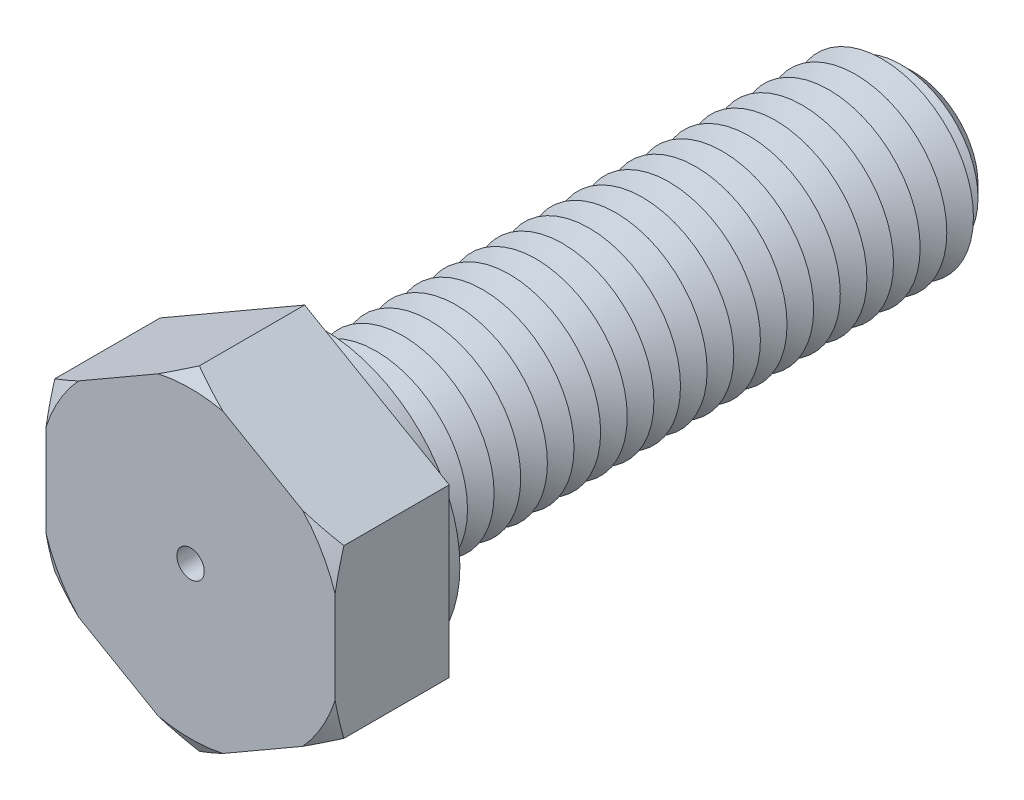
from build123d import *

# Parameters (mm, degrees)
BOSS_EXTRUDE1_DEPTH = 7.5
SKETCH3_R           = 6
BOSS_EXTRUDE2_DEPTH = 40
SKETCH4_R           = 9
BOSS_EXTRUDE3_DEPTH = 1.2
CHAMFER1_SIZE       = 1.75
LPATTERN1_COUNT     = 22
LPATTERN1_PITCH     = 1.75
SKETCH8_R           = 0.9
CUT_EXTRUDE1_DEPTH  = 47.5


with BuildPart() as part:
    # Sketch2 → Boss-Extrude1 (new body)
    with BuildSketch(Plane.XY):
        Polygon((0, 10.969655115), (-9.5, 5.484827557), (-9.5, -5.484827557), (0, -10.969655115), (9.5, -5.484827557), (9.5, 5.484827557), align=None)
    extrude(amount=BOSS_EXTRUDE1_DEPTH)

    # Sketch3 → Boss-Extrude2 (add)
    with BuildSketch(Plane(origin=(0, 0, 0), x_dir=(-1, 0, 0), z_dir=(0, 0, -1))):
        Circle(SKETCH3_R)
    extrude(amount=BOSS_EXTRUDE2_DEPTH)

    # Sketch4 → Boss-Extrude3 (add)
    with BuildSketch(Plane(origin=(0, 0, 0), x_dir=(-1, 0, 0), z_dir=(0, 0, -1))):
        with Locations(Location((0, 0, 0), (0, 0, 180))):
            Circle(SKETCH4_R)
    extrude(amount=BOSS_EXTRUDE3_DEPTH)

    # Chamfer1
    chamfer1_edges = [part.edges().sort_by_distance(p)[0] for p in [
        (6, 0, -40),
    ]]
    chamfer(chamfer1_edges, length=CHAMFER1_SIZE)

    # Sketch6 → Cut-Revolve1 (revolve, cut)
    with BuildSketch(Plane(origin=(0, 0, 0), x_dir=(0, 0, -1), z_dir=(1, 0, 0)), mode=Mode.PRIVATE) as cut_revolve1_sk:
        Polygon((1.2, 6), (2.075, 4.484455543), (2.95, 6), align=None)
    cut_revolve1 = revolve(cut_revolve1_sk.sketch.rotate(Axis((0, 0, 3.211670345), (0, 0, -1)), 90), axis=Axis((0, 0, 3.211670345), (0, 0, -1)), mode=Mode.SUBTRACT)

    # LPattern1: Cut-Revolve1 ×22
    with Locations(*[(0, 0, -i * LPATTERN1_PITCH) for i in range(1, LPATTERN1_COUNT)]):
        add(cut_revolve1, mode=Mode.SUBTRACT)

    # Sketch7 → Cut-Revolve2 (revolve, cut)
    with BuildSketch(Plane(origin=(0, 0, 0), x_dir=(0, 0, -1), z_dir=(1, 0, 0)), mode=Mode.PRIVATE) as cut_revolve2_sk:
        Polygon((-7.5, 10.969655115), (-7.5, 9.969655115), (-6.922649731, 10.969655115), align=None)
    revolve(cut_revolve2_sk.sketch.rotate(Axis((0, 0, 3.211670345), (0, 0, -1)), 90), axis=Axis((0, 0, 3.211670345), (0, 0, -1)), mode=Mode.SUBTRACT)

    # Sketch8 → Cut-Extrude1 (cut)
    with BuildSketch(Plane.XY.offset(7.5)):
        Circle(SKETCH8_R)
    extrude(amount=-CUT_EXTRUDE1_DEPTH, mode=Mode.SUBTRACT)


solid = part.part
